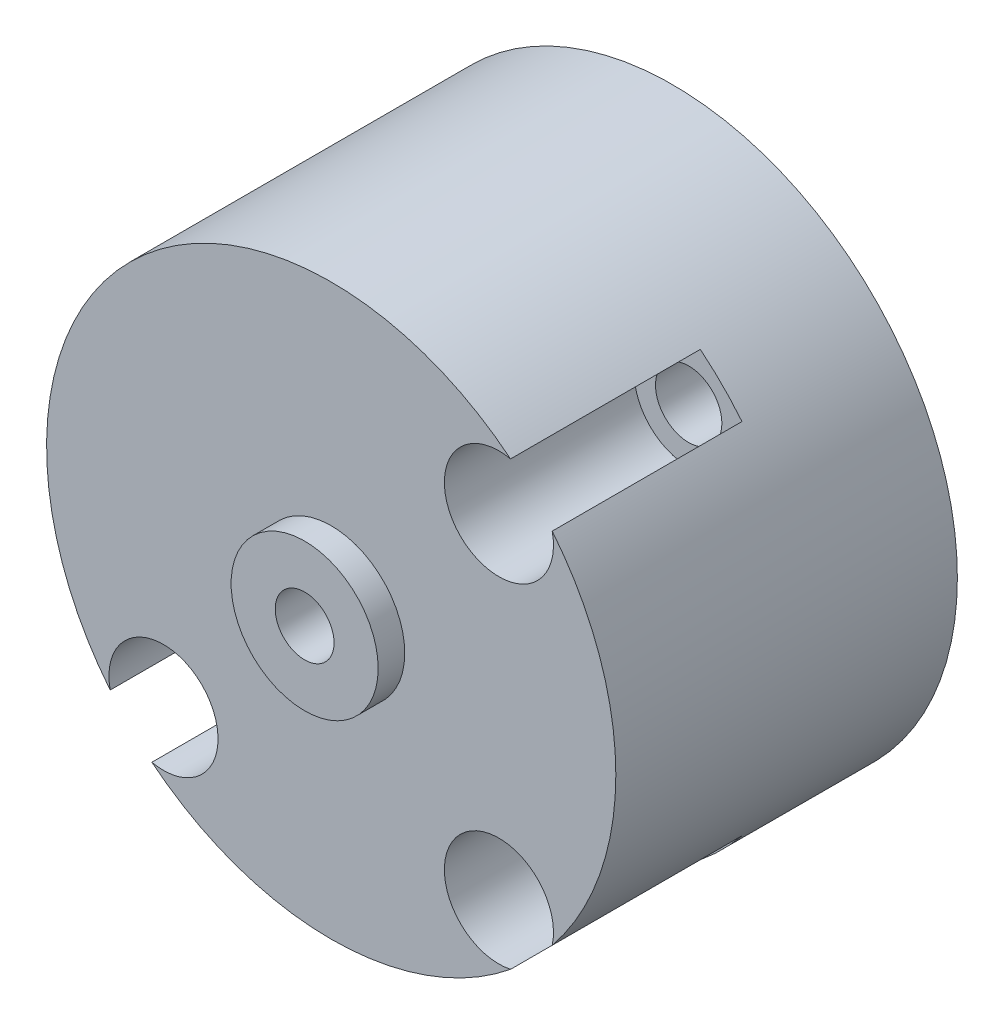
ISO-10303-21;
HEADER;
FILE_DESCRIPTION(('STEP AP214'),'2;1');
FILE_NAME('part.step','',(''),(''),'','','');
FILE_SCHEMA(('AUTOMOTIVE_DESIGN { 1 0 10303 214 1 1 1 1 }'));
ENDSEC;
DATA;
#1=APPLICATION_CONTEXT('core data for automotive mechanical design processes');
#2=APPLICATION_PROTOCOL_DEFINITION('international standard','automotive_design',2000,#1);
#3=PRODUCT_CONTEXT('',#1,'mechanical');
#4=PRODUCT('Part','Part','',(#3));
#5=PRODUCT_RELATED_PRODUCT_CATEGORY('part','',(#4));
#6=PRODUCT_DEFINITION_FORMATION('','',#4);
#7=PRODUCT_DEFINITION_CONTEXT('part definition',#1,'design');
#8=PRODUCT_DEFINITION('design','',#6,#7);
#9=PRODUCT_DEFINITION_SHAPE('','',#8);
#10=(LENGTH_UNIT() NAMED_UNIT(*) SI_UNIT(.MILLI.,.METRE.));
#11=(NAMED_UNIT(*) PLANE_ANGLE_UNIT() SI_UNIT($,.RADIAN.));
#12=(NAMED_UNIT(*) SI_UNIT($,.STERADIAN.) SOLID_ANGLE_UNIT());
#13=UNCERTAINTY_MEASURE_WITH_UNIT(LENGTH_MEASURE(1.E-05),#10,'distance_accuracy_value','');
#14=(GEOMETRIC_REPRESENTATION_CONTEXT(3) GLOBAL_UNCERTAINTY_ASSIGNED_CONTEXT((#13)) GLOBAL_UNIT_ASSIGNED_CONTEXT((#10,
#11,#12)) REPRESENTATION_CONTEXT('',''));
#15=CARTESIAN_POINT('',(0.,0.,0.));
#16=DIRECTION('',(0.,0.,1.));
#17=DIRECTION('',(1.,0.,0.));
#18=AXIS2_PLACEMENT_3D('',#15,#16,#17);
#19=CARTESIAN_POINT('',(1.56529891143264E-12,158.044580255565,2.));
#20=DIRECTION('',(0.,0.,1.));
#21=DIRECTION('',(1.,0.,0.));
#22=AXIS2_PLACEMENT_3D('',#19,#20,#21);
#23=CYLINDRICAL_SURFACE('',#22,1.55);
#24=CARTESIAN_POINT('',(4.41053443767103E-13,158.044580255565,19.4));
#25=DIRECTION('',(0.,0.,1.));
#26=DIRECTION('',(1.,0.,0.));
#27=AXIS2_PLACEMENT_3D('',#24,#25,#26);
#28=CIRCLE('',#27,1.55);
#29=CARTESIAN_POINT('',(1.55000000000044,158.044580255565,19.4));
#30=VERTEX_POINT('',#29);
#31=EDGE_CURVE('E207',#30,#30,#28,.T.);
#32=ORIENTED_EDGE('',*,*,#31,.T.);
#33=EDGE_LOOP('',(#32));
#34=FACE_BOUND('',#33,.T.);
#35=CARTESIAN_POINT('',(1.56529891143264E-12,158.044580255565,15.3));
#36=DIRECTION('',(0.,0.,-1.));
#37=DIRECTION('',(-1.,0.,0.));
#38=AXIS2_PLACEMENT_3D('',#35,#36,#37);
#39=CIRCLE('',#38,1.55);
#40=CARTESIAN_POINT('',(-1.54999999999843,158.044580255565,15.3));
#41=VERTEX_POINT('',#40);
#42=EDGE_CURVE('E176',#41,#41,#39,.F.);
#43=ORIENTED_EDGE('',*,*,#42,.F.);
#44=EDGE_LOOP('',(#43));
#45=FACE_BOUND('',#44,.T.);
#46=ADVANCED_FACE('F37',(#34,#45),#23,.F.);
#47=CARTESIAN_POINT('',(1.56529891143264E-12,158.044580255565,18.));
#48=DIRECTION('',(0.,0.,1.));
#49=DIRECTION('',(1.,0.,0.));
#50=AXIS2_PLACEMENT_3D('',#47,#48,#49);
#51=PLANE('',#50);
#52=CARTESIAN_POINT('',(8.8388347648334,166.883415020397,18.));
#53=DIRECTION('',(0.,0.,1.));
#54=DIRECTION('',(1.,0.,0.));
#55=AXIS2_PLACEMENT_3D('',#52,#53,#54);
#56=CIRCLE('',#55,2.875);
#57=CARTESIAN_POINT('',(9.45135409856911,169.692408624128,18.));
#58=VERTEX_POINT('',#57);
#59=CARTESIAN_POINT('',(11.6478283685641,167.495934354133,18.));
#60=VERTEX_POINT('',#59);
#61=EDGE_CURVE('E193',#58,#60,#56,.T.);
#62=ORIENTED_EDGE('',*,*,#61,.F.);
#63=CARTESIAN_POINT('',(1.56529891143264E-12,158.044580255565,18.));
#64=DIRECTION('',(0.,0.,1.));
#65=DIRECTION('',(1.,0.,0.));
#66=AXIS2_PLACEMENT_3D('',#63,#64,#65);
#67=CIRCLE('',#66,15.);
#68=CARTESIAN_POINT('',(-11.6478283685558,148.593226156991,18.));
#69=VERTEX_POINT('',#68);
#70=EDGE_CURVE('E220',#58,#69,#67,.T.);
#71=ORIENTED_EDGE('',*,*,#70,.T.);
#72=CARTESIAN_POINT('',(-8.83883476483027,149.205745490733,18.));
#73=DIRECTION('',(0.,0.,1.));
#74=DIRECTION('',(1.,0.,0.));
#75=AXIS2_PLACEMENT_3D('',#72,#73,#74);
#76=CIRCLE('',#75,2.87499999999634);
#77=CARTESIAN_POINT('',(-9.4513540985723,146.396751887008,18.));
#78=VERTEX_POINT('',#77);
#79=EDGE_CURVE('E199',#78,#69,#76,.T.);
#80=ORIENTED_EDGE('',*,*,#79,.F.);
#81=CARTESIAN_POINT('',(9.45135409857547,146.396751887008,18.));
#82=VERTEX_POINT('',#81);
#83=EDGE_CURVE('E219',#78,#82,#67,.T.);
#84=ORIENTED_EDGE('',*,*,#83,.T.);
#85=CARTESIAN_POINT('',(8.83883476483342,149.205745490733,18.));
#86=DIRECTION('',(0.,0.,1.));
#87=DIRECTION('',(1.,0.,0.));
#88=AXIS2_PLACEMENT_3D('',#85,#86,#87);
#89=CIRCLE('',#88,2.87499999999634);
#90=CARTESIAN_POINT('',(11.647828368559,148.593226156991,18.));
#91=VERTEX_POINT('',#90);
#92=EDGE_CURVE('E195',#91,#82,#89,.T.);
#93=ORIENTED_EDGE('',*,*,#92,.F.);
#94=EDGE_CURVE('E214',#91,#60,#67,.T.);
#95=ORIENTED_EDGE('',*,*,#94,.T.);
#96=EDGE_LOOP('',(#62,#71,#80,#84,#93,#95));
#97=FACE_BOUND('',#96,.T.);
#98=CARTESIAN_POINT('',(4.41053443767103E-13,158.044580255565,18.));
#99=DIRECTION('',(0.,0.,1.));
#100=DIRECTION('',(1.,0.,0.));
#101=AXIS2_PLACEMENT_3D('',#98,#99,#100);
#102=CIRCLE('',#101,3.875);
#103=CARTESIAN_POINT('',(3.87500000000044,158.044580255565,18.));
#104=VERTEX_POINT('',#103);
#105=EDGE_CURVE('E210',#104,#104,#102,.T.);
#106=ORIENTED_EDGE('',*,*,#105,.F.);
#107=EDGE_LOOP('',(#106));
#108=FACE_BOUND('',#107,.T.);
#109=ADVANCED_FACE('F282',(#97,#108),#51,.T.);
#110=CARTESIAN_POINT('',(8.83883476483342,149.205745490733,5.));
#111=DIRECTION('',(0.,0.,-1.));
#112=DIRECTION('',(-1.,0.,0.));
#113=AXIS2_PLACEMENT_3D('',#110,#111,#112);
#114=CYLINDRICAL_SURFACE('',#113,1.75);
#115=CARTESIAN_POINT('',(8.83883476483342,149.205745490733,0.));
#116=DIRECTION('',(0.,0.,1.));
#117=DIRECTION('',(1.,0.,0.));
#118=AXIS2_PLACEMENT_3D('',#115,#116,#117);
#119=CIRCLE('',#118,1.75);
#120=CARTESIAN_POINT('',(10.5888347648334,149.205745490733,0.));
#121=VERTEX_POINT('',#120);
#122=EDGE_CURVE('E227',#121,#121,#119,.T.);
#123=ORIENTED_EDGE('',*,*,#122,.F.);
#124=EDGE_LOOP('',(#123));
#125=FACE_BOUND('',#124,.T.);
#126=CARTESIAN_POINT('',(8.83883476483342,149.205745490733,8.));
#127=DIRECTION('',(0.,0.,1.));
#128=DIRECTION('',(1.,0.,0.));
#129=AXIS2_PLACEMENT_3D('',#126,#127,#128);
#130=CIRCLE('',#129,1.75);
#131=CARTESIAN_POINT('',(10.5888347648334,149.205745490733,8.));
#132=VERTEX_POINT('',#131);
#133=EDGE_CURVE('E251',#132,#132,#130,.T.);
#134=ORIENTED_EDGE('',*,*,#133,.T.);
#135=EDGE_LOOP('',(#134));
#136=FACE_BOUND('',#135,.T.);
#137=ADVANCED_FACE('F308',(#125,#136),#114,.F.);
#138=CARTESIAN_POINT('',(8.8388347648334,166.883415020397,5.));
#139=DIRECTION('',(0.,0.,-1.));
#140=DIRECTION('',(-1.,0.,0.));
#141=AXIS2_PLACEMENT_3D('',#138,#139,#140);
#142=CYLINDRICAL_SURFACE('',#141,1.75);
#143=CARTESIAN_POINT('',(8.8388347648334,166.883415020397,0.));
#144=DIRECTION('',(0.,0.,1.));
#145=DIRECTION('',(1.,0.,0.));
#146=AXIS2_PLACEMENT_3D('',#143,#144,#145);
#147=CIRCLE('',#146,1.75);
#148=CARTESIAN_POINT('',(10.5888347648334,166.883415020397,0.));
#149=VERTEX_POINT('',#148);
#150=EDGE_CURVE('E224',#149,#149,#147,.T.);
#151=ORIENTED_EDGE('',*,*,#150,.F.);
#152=EDGE_LOOP('',(#151));
#153=FACE_BOUND('',#152,.T.);
#154=CARTESIAN_POINT('',(8.8388347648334,166.883415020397,8.));
#155=DIRECTION('',(0.,0.,1.));
#156=DIRECTION('',(1.,0.,0.));
#157=AXIS2_PLACEMENT_3D('',#154,#155,#156);
#158=CIRCLE('',#157,1.75);
#159=CARTESIAN_POINT('',(10.5888347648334,166.883415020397,8.));
#160=VERTEX_POINT('',#159);
#161=EDGE_CURVE('E249',#160,#160,#158,.T.);
#162=ORIENTED_EDGE('',*,*,#161,.T.);
#163=EDGE_LOOP('',(#162));
#164=FACE_BOUND('',#163,.T.);
#165=ADVANCED_FACE('F316',(#153,#164),#142,.F.);
#166=CARTESIAN_POINT('',(-8.83883476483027,149.205745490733,5.));
#167=DIRECTION('',(0.,0.,-1.));
#168=DIRECTION('',(-1.,0.,0.));
#169=AXIS2_PLACEMENT_3D('',#166,#167,#168);
#170=CYLINDRICAL_SURFACE('',#169,1.75);
#171=CARTESIAN_POINT('',(-8.83883476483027,149.205745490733,0.));
#172=DIRECTION('',(0.,0.,1.));
#173=DIRECTION('',(1.,0.,0.));
#174=AXIS2_PLACEMENT_3D('',#171,#172,#173);
#175=CIRCLE('',#174,1.75);
#176=CARTESIAN_POINT('',(-7.08883476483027,149.205745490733,0.));
#177=VERTEX_POINT('',#176);
#178=EDGE_CURVE('E221',#177,#177,#175,.T.);
#179=ORIENTED_EDGE('',*,*,#178,.F.);
#180=EDGE_LOOP('',(#179));
#181=FACE_BOUND('',#180,.T.);
#182=CARTESIAN_POINT('',(-8.83883476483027,149.205745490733,8.));
#183=DIRECTION('',(0.,0.,1.));
#184=DIRECTION('',(1.,0.,0.));
#185=AXIS2_PLACEMENT_3D('',#182,#183,#184);
#186=CIRCLE('',#185,1.75);
#187=CARTESIAN_POINT('',(-7.08883476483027,149.205745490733,8.));
#188=VERTEX_POINT('',#187);
#189=EDGE_CURVE('E41',#188,#188,#186,.T.);
#190=ORIENTED_EDGE('',*,*,#189,.T.);
#191=EDGE_LOOP('',(#190));
#192=FACE_BOUND('',#191,.T.);
#193=ADVANCED_FACE('F258',(#181,#192),#170,.F.);
#194=CARTESIAN_POINT('',(1.56529891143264E-12,158.044580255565,0.));
#195=DIRECTION('',(0.,0.,1.));
#196=DIRECTION('',(1.,0.,0.));
#197=AXIS2_PLACEMENT_3D('',#194,#195,#196);
#198=PLANE('',#197);
#199=CARTESIAN_POINT('',(-4.53416912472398E-11,158.044580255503,0.));
#200=DIRECTION('',(0.,0.,-1.));
#201=DIRECTION('',(-1.,0.,0.));
#202=AXIS2_PLACEMENT_3D('',#199,#200,#201);
#203=CIRCLE('',#202,3.99999999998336);
#204=CARTESIAN_POINT('',(-4.00000000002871,158.044580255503,0.));
#205=VERTEX_POINT('',#204);
#206=EDGE_CURVE('E188',#205,#205,#203,.T.);
#207=ORIENTED_EDGE('',*,*,#206,.F.);
#208=EDGE_LOOP('',(#207));
#209=FACE_BOUND('',#208,.T.);
#210=CARTESIAN_POINT('',(1.56529891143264E-12,158.044580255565,0.));
#211=DIRECTION('',(0.,0.,1.));
#212=DIRECTION('',(1.,0.,0.));
#213=AXIS2_PLACEMENT_3D('',#210,#211,#212);
#214=CIRCLE('',#213,15.);
#215=CARTESIAN_POINT('',(15.0000000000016,158.044580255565,0.));
#216=VERTEX_POINT('',#215);
#217=EDGE_CURVE('E230',#216,#216,#214,.T.);
#218=ORIENTED_EDGE('',*,*,#217,.F.);
#219=EDGE_LOOP('',(#218));
#220=FACE_BOUND('',#219,.T.);
#221=ORIENTED_EDGE('',*,*,#122,.T.);
#222=EDGE_LOOP('',(#221));
#223=FACE_BOUND('',#222,.T.);
#224=ORIENTED_EDGE('',*,*,#150,.T.);
#225=EDGE_LOOP('',(#224));
#226=FACE_BOUND('',#225,.T.);
#227=ORIENTED_EDGE('',*,*,#178,.T.);
#228=EDGE_LOOP('',(#227));
#229=FACE_BOUND('',#228,.T.);
#230=ADVANCED_FACE('F315',(#209,#220,#223,#226,#229),#198,.F.);
#231=CARTESIAN_POINT('',(1.56529891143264E-12,158.044580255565,5.));
#232=DIRECTION('',(0.,0.,-1.));
#233=DIRECTION('',(-1.,0.,0.));
#234=AXIS2_PLACEMENT_3D('',#231,#232,#233);
#235=CYLINDRICAL_SURFACE('',#234,15.);
#236=ORIENTED_EDGE('',*,*,#217,.T.);
#237=EDGE_LOOP('',(#236));
#238=FACE_BOUND('',#237,.T.);
#239=CARTESIAN_POINT('',(1.56529891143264E-12,158.044580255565,8.));
#240=DIRECTION('',(0.,0.,1.));
#241=DIRECTION('',(1.,0.,0.));
#242=AXIS2_PLACEMENT_3D('',#239,#240,#241);
#243=CIRCLE('',#242,15.);
#244=CARTESIAN_POINT('',(11.6478283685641,167.495934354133,8.));
#245=VERTEX_POINT('',#244);
#246=CARTESIAN_POINT('',(9.45135409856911,169.692408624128,8.));
#247=VERTEX_POINT('',#246);
#248=EDGE_CURVE('E205',#245,#247,#243,.T.);
#249=ORIENTED_EDGE('',*,*,#248,.F.);
#250=DIRECTION('',(0.,0.,1.));
#251=VECTOR('',#250,1.);
#252=CARTESIAN_POINT('',(11.6478283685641,167.495934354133,13.));
#253=LINE('',#252,#251);
#254=EDGE_CURVE('E11',#245,#60,#253,.T.);
#255=ORIENTED_EDGE('',*,*,#254,.T.);
#256=ORIENTED_EDGE('',*,*,#94,.F.);
#257=DIRECTION('',(0.,0.,1.));
#258=VECTOR('',#257,1.);
#259=CARTESIAN_POINT('',(11.647828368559,148.593226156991,13.));
#260=LINE('',#259,#258);
#261=CARTESIAN_POINT('',(11.647828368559,148.593226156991,8.));
#262=VERTEX_POINT('',#261);
#263=EDGE_CURVE('E239',#91,#262,#260,.F.);
#264=ORIENTED_EDGE('',*,*,#263,.T.);
#265=CARTESIAN_POINT('',(1.56529891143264E-12,158.044580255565,8.));
#266=DIRECTION('',(0.,0.,1.));
#267=DIRECTION('',(1.,0.,0.));
#268=AXIS2_PLACEMENT_3D('',#265,#266,#267);
#269=CIRCLE('',#268,15.);
#270=CARTESIAN_POINT('',(9.45135409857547,146.396751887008,8.));
#271=VERTEX_POINT('',#270);
#272=EDGE_CURVE('E203',#271,#262,#269,.T.);
#273=ORIENTED_EDGE('',*,*,#272,.F.);
#274=DIRECTION('',(0.,0.,1.));
#275=VECTOR('',#274,1.);
#276=CARTESIAN_POINT('',(9.45135409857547,146.396751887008,13.));
#277=LINE('',#276,#275);
#278=EDGE_CURVE('E242',#271,#82,#277,.T.);
#279=ORIENTED_EDGE('',*,*,#278,.T.);
#280=ORIENTED_EDGE('',*,*,#83,.F.);
#281=DIRECTION('',(0.,0.,1.));
#282=VECTOR('',#281,1.);
#283=CARTESIAN_POINT('',(-9.45135409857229,146.396751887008,13.));
#284=LINE('',#283,#282);
#285=CARTESIAN_POINT('',(-9.4513540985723,146.396751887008,8.));
#286=VERTEX_POINT('',#285);
#287=EDGE_CURVE('E233',#78,#286,#284,.F.);
#288=ORIENTED_EDGE('',*,*,#287,.T.);
#289=CARTESIAN_POINT('',(1.56529891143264E-12,158.044580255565,8.));
#290=DIRECTION('',(0.,0.,1.));
#291=DIRECTION('',(1.,0.,0.));
#292=AXIS2_PLACEMENT_3D('',#289,#290,#291);
#293=CIRCLE('',#292,15.);
#294=CARTESIAN_POINT('',(-11.6478283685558,148.593226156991,8.));
#295=VERTEX_POINT('',#294);
#296=EDGE_CURVE('E192',#295,#286,#293,.T.);
#297=ORIENTED_EDGE('',*,*,#296,.F.);
#298=DIRECTION('',(0.,0.,1.));
#299=VECTOR('',#298,1.);
#300=CARTESIAN_POINT('',(-11.6478283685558,148.593226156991,13.));
#301=LINE('',#300,#299);
#302=EDGE_CURVE('E236',#295,#69,#301,.T.);
#303=ORIENTED_EDGE('',*,*,#302,.T.);
#304=ORIENTED_EDGE('',*,*,#70,.F.);
#305=DIRECTION('',(0.,0.,1.));
#306=VECTOR('',#305,1.);
#307=CARTESIAN_POINT('',(9.45135409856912,169.692408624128,13.));
#308=LINE('',#307,#306);
#309=EDGE_CURVE('E46',#58,#247,#308,.F.);
#310=ORIENTED_EDGE('',*,*,#309,.T.);
#311=EDGE_LOOP('',(#249,#255,#256,#264,#273,#279,#280,#288,#297,#303,#304,#310));
#312=FACE_BOUND('',#311,.T.);
#313=ADVANCED_FACE('F39',(#238,#312),#235,.T.);
#314=CARTESIAN_POINT('',(4.41053443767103E-13,158.044580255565,19.4));
#315=DIRECTION('',(0.,0.,1.));
#316=DIRECTION('',(1.,0.,0.));
#317=AXIS2_PLACEMENT_3D('',#314,#315,#316);
#318=PLANE('',#317);
#319=CARTESIAN_POINT('',(4.41053443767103E-13,158.044580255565,19.4));
#320=DIRECTION('',(0.,0.,1.));
#321=DIRECTION('',(1.,0.,0.));
#322=AXIS2_PLACEMENT_3D('',#319,#320,#321);
#323=CIRCLE('',#322,3.875);
#324=CARTESIAN_POINT('',(3.87500000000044,158.044580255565,19.4));
#325=VERTEX_POINT('',#324);
#326=EDGE_CURVE('E211',#325,#325,#323,.T.);
#327=ORIENTED_EDGE('',*,*,#326,.T.);
#328=EDGE_LOOP('',(#327));
#329=FACE_BOUND('',#328,.T.);
#330=ORIENTED_EDGE('',*,*,#31,.F.);
#331=EDGE_LOOP('',(#330));
#332=FACE_BOUND('',#331,.T.);
#333=ADVANCED_FACE('F328',(#329,#332),#318,.T.);
#334=CARTESIAN_POINT('',(4.41053443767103E-13,158.044580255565,19.4));
#335=DIRECTION('',(0.,0.,-1.));
#336=DIRECTION('',(-1.,0.,0.));
#337=AXIS2_PLACEMENT_3D('',#334,#335,#336);
#338=CYLINDRICAL_SURFACE('',#337,3.875);
#339=ORIENTED_EDGE('',*,*,#326,.F.);
#340=EDGE_LOOP('',(#339));
#341=FACE_BOUND('',#340,.T.);
#342=ORIENTED_EDGE('',*,*,#105,.T.);
#343=EDGE_LOOP('',(#342));
#344=FACE_BOUND('',#343,.T.);
#345=ADVANCED_FACE('F520',(#341,#344),#338,.T.);
#346=CARTESIAN_POINT('',(-8.83883476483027,149.205745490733,8.));
#347=DIRECTION('',(0.,0.,1.));
#348=DIRECTION('',(1.,0.,0.));
#349=AXIS2_PLACEMENT_3D('',#346,#347,#348);
#350=CYLINDRICAL_SURFACE('',#349,2.87499999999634);
#351=CARTESIAN_POINT('',(-8.83883476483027,149.205745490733,8.));
#352=DIRECTION('',(0.,0.,1.));
#353=DIRECTION('',(1.,0.,0.));
#354=AXIS2_PLACEMENT_3D('',#351,#352,#353);
#355=CIRCLE('',#354,2.87499999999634);
#356=EDGE_CURVE('E187',#286,#295,#355,.T.);
#357=ORIENTED_EDGE('',*,*,#356,.F.);
#358=ORIENTED_EDGE('',*,*,#287,.F.);
#359=ORIENTED_EDGE('',*,*,#79,.T.);
#360=ORIENTED_EDGE('',*,*,#302,.F.);
#361=EDGE_LOOP('',(#357,#358,#359,#360));
#362=FACE_BOUND('',#361,.T.);
#363=ADVANCED_FACE('F264',(#362),#350,.F.);
#364=CARTESIAN_POINT('',(-8.83883476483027,149.205745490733,8.));
#365=DIRECTION('',(0.,0.,1.));
#366=DIRECTION('',(1.,0.,0.));
#367=AXIS2_PLACEMENT_3D('',#364,#365,#366);
#368=PLANE('',#367);
#369=ORIENTED_EDGE('',*,*,#189,.F.);
#370=EDGE_LOOP('',(#369));
#371=FACE_BOUND('',#370,.T.);
#372=ORIENTED_EDGE('',*,*,#296,.T.);
#373=ORIENTED_EDGE('',*,*,#356,.T.);
#374=EDGE_LOOP('',(#372,#373));
#375=FACE_BOUND('',#374,.T.);
#376=ADVANCED_FACE('F260',(#371,#375),#368,.T.);
#377=CARTESIAN_POINT('',(8.83883476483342,149.205745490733,8.));
#378=DIRECTION('',(0.,0.,1.));
#379=DIRECTION('',(1.,0.,0.));
#380=AXIS2_PLACEMENT_3D('',#377,#378,#379);
#381=CYLINDRICAL_SURFACE('',#380,2.87499999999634);
#382=CARTESIAN_POINT('',(8.83883476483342,149.205745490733,8.));
#383=DIRECTION('',(0.,0.,1.));
#384=DIRECTION('',(1.,0.,0.));
#385=AXIS2_PLACEMENT_3D('',#382,#383,#384);
#386=CIRCLE('',#385,2.87499999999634);
#387=EDGE_CURVE('E197',#262,#271,#386,.T.);
#388=ORIENTED_EDGE('',*,*,#387,.F.);
#389=ORIENTED_EDGE('',*,*,#263,.F.);
#390=ORIENTED_EDGE('',*,*,#92,.T.);
#391=ORIENTED_EDGE('',*,*,#278,.F.);
#392=EDGE_LOOP('',(#388,#389,#390,#391));
#393=FACE_BOUND('',#392,.T.);
#394=ADVANCED_FACE('F263',(#393),#381,.F.);
#395=CARTESIAN_POINT('',(8.83883476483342,149.205745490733,8.));
#396=DIRECTION('',(0.,0.,1.));
#397=DIRECTION('',(1.,0.,0.));
#398=AXIS2_PLACEMENT_3D('',#395,#396,#397);
#399=PLANE('',#398);
#400=ORIENTED_EDGE('',*,*,#133,.F.);
#401=EDGE_LOOP('',(#400));
#402=FACE_BOUND('',#401,.T.);
#403=ORIENTED_EDGE('',*,*,#272,.T.);
#404=ORIENTED_EDGE('',*,*,#387,.T.);
#405=EDGE_LOOP('',(#403,#404));
#406=FACE_BOUND('',#405,.T.);
#407=ADVANCED_FACE('F290',(#402,#406),#399,.T.);
#408=CARTESIAN_POINT('',(8.8388347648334,166.883415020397,8.));
#409=DIRECTION('',(0.,0.,1.));
#410=DIRECTION('',(1.,0.,0.));
#411=AXIS2_PLACEMENT_3D('',#408,#409,#410);
#412=CYLINDRICAL_SURFACE('',#411,2.875);
#413=CARTESIAN_POINT('',(8.8388347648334,166.883415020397,8.));
#414=DIRECTION('',(0.,0.,1.));
#415=DIRECTION('',(1.,0.,0.));
#416=AXIS2_PLACEMENT_3D('',#413,#414,#415);
#417=CIRCLE('',#416,2.875);
#418=EDGE_CURVE('E61',#247,#245,#417,.T.);
#419=ORIENTED_EDGE('',*,*,#418,.F.);
#420=ORIENTED_EDGE('',*,*,#309,.F.);
#421=ORIENTED_EDGE('',*,*,#61,.T.);
#422=ORIENTED_EDGE('',*,*,#254,.F.);
#423=EDGE_LOOP('',(#419,#420,#421,#422));
#424=FACE_BOUND('',#423,.T.);
#425=ADVANCED_FACE('F285',(#424),#412,.F.);
#426=CARTESIAN_POINT('',(8.8388347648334,166.883415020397,8.));
#427=DIRECTION('',(0.,0.,1.));
#428=DIRECTION('',(1.,0.,0.));
#429=AXIS2_PLACEMENT_3D('',#426,#427,#428);
#430=PLANE('',#429);
#431=ORIENTED_EDGE('',*,*,#161,.F.);
#432=EDGE_LOOP('',(#431));
#433=FACE_BOUND('',#432,.T.);
#434=ORIENTED_EDGE('',*,*,#248,.T.);
#435=ORIENTED_EDGE('',*,*,#418,.T.);
#436=EDGE_LOOP('',(#434,#435));
#437=FACE_BOUND('',#436,.T.);
#438=ADVANCED_FACE('F298',(#433,#437),#430,.T.);
#439=CARTESIAN_POINT('',(-4.53416912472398E-11,158.044580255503,12.));
#440=DIRECTION('',(0.,0.,-1.));
#441=DIRECTION('',(-1.,0.,0.));
#442=AXIS2_PLACEMENT_3D('',#439,#440,#441);
#443=PLANE('',#442);
#444=DIRECTION('',(0.260031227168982,0.965600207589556,0.));
#445=VECTOR('',#444,1.);
#446=CARTESIAN_POINT('',(-3.62612024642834,157.077840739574,12.));
#447=LINE('',#446,#445);
#448=CARTESIAN_POINT('',(-3.62612024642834,157.077840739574,12.));
#449=VERTEX_POINT('',#448);
#450=CARTESIAN_POINT('',(-2.65028110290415,160.701522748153,12.));
#451=VERTEX_POINT('',#450);
#452=EDGE_CURVE('E54',#449,#451,#447,.T.);
#453=ORIENTED_EDGE('',*,*,#452,.F.);
#454=DIRECTION('',(-0.706218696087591,0.70799375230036,0.));
#455=VECTOR('',#454,1.);
#456=CARTESIAN_POINT('',(-0.975839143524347,154.420898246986,12.));
#457=LINE('',#456,#455);
#458=CARTESIAN_POINT('',(-0.975839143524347,154.420898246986,12.));
#459=VERTEX_POINT('',#458);
#460=EDGE_CURVE('E150',#459,#449,#457,.T.);
#461=ORIENTED_EDGE('',*,*,#460,.F.);
#462=DIRECTION('',(-0.966249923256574,-0.257606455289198,0.));
#463=VECTOR('',#462,1.);
#464=CARTESIAN_POINT('',(2.65028110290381,155.387637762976,12.));
#465=LINE('',#464,#463);
#466=CARTESIAN_POINT('',(2.65028110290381,155.387637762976,12.));
#467=VERTEX_POINT('',#466);
#468=EDGE_CURVE('E153',#467,#459,#465,.T.);
#469=ORIENTED_EDGE('',*,*,#468,.F.);
#470=DIRECTION('',(-0.260031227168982,-0.965600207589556,0.));
#471=VECTOR('',#470,1.);
#472=CARTESIAN_POINT('',(3.626120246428,159.011319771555,12.));
#473=LINE('',#472,#471);
#474=CARTESIAN_POINT('',(3.626120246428,159.011319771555,12.));
#475=VERTEX_POINT('',#474);
#476=EDGE_CURVE('E169',#475,#467,#473,.T.);
#477=ORIENTED_EDGE('',*,*,#476,.F.);
#478=DIRECTION('',(0.706218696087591,-0.707993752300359,0.));
#479=VECTOR('',#478,1.);
#480=CARTESIAN_POINT('',(0.975839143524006,161.668262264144,12.));
#481=LINE('',#480,#479);
#482=CARTESIAN_POINT('',(0.975839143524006,161.668262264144,12.));
#483=VERTEX_POINT('',#482);
#484=EDGE_CURVE('E166',#483,#475,#481,.T.);
#485=ORIENTED_EDGE('',*,*,#484,.F.);
#486=DIRECTION('',(0.966249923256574,0.257606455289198,0.));
#487=VECTOR('',#486,1.);
#488=CARTESIAN_POINT('',(-2.65028110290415,160.701522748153,12.));
#489=LINE('',#488,#487);
#490=EDGE_CURVE('E164',#451,#483,#489,.T.);
#491=ORIENTED_EDGE('',*,*,#490,.F.);
#492=EDGE_LOOP('',(#453,#461,#469,#477,#485,#491));
#493=FACE_BOUND('',#492,.T.);
#494=CARTESIAN_POINT('',(-4.53416912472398E-11,158.044580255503,12.));
#495=DIRECTION('',(0.,0.,-1.));
#496=DIRECTION('',(-1.,0.,0.));
#497=AXIS2_PLACEMENT_3D('',#494,#495,#496);
#498=CIRCLE('',#497,3.99999999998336);
#499=CARTESIAN_POINT('',(-4.00000000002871,158.044580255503,12.));
#500=VERTEX_POINT('',#499);
#501=EDGE_CURVE('E184',#500,#500,#498,.T.);
#502=ORIENTED_EDGE('',*,*,#501,.T.);
#503=EDGE_LOOP('',(#502));
#504=FACE_BOUND('',#503,.T.);
#505=ADVANCED_FACE('F343',(#493,#504),#443,.T.);
#506=CARTESIAN_POINT('',(-4.53416912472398E-11,158.044580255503,12.));
#507=DIRECTION('',(0.,0.,-1.));
#508=DIRECTION('',(-1.,0.,0.));
#509=AXIS2_PLACEMENT_3D('',#506,#507,#508);
#510=CYLINDRICAL_SURFACE('',#509,3.99999999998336);
#511=ORIENTED_EDGE('',*,*,#501,.F.);
#512=EDGE_LOOP('',(#511));
#513=FACE_BOUND('',#512,.T.);
#514=ORIENTED_EDGE('',*,*,#206,.T.);
#515=EDGE_LOOP('',(#514));
#516=FACE_BOUND('',#515,.T.);
#517=ADVANCED_FACE('F348',(#513,#516),#510,.F.);
#518=CARTESIAN_POINT('',(0.,0.,15.3));
#519=DIRECTION('',(0.,0.,-1.));
#520=DIRECTION('',(-1.,0.,0.));
#521=AXIS2_PLACEMENT_3D('',#518,#519,#520);
#522=PLANE('',#521);
#523=DIRECTION('',(0.260031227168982,0.965600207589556,0.));
#524=VECTOR('',#523,1.);
#525=CARTESIAN_POINT('',(-3.62612024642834,157.077840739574,15.3));
#526=LINE('',#525,#524);
#527=CARTESIAN_POINT('',(-3.62612024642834,157.077840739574,15.3));
#528=VERTEX_POINT('',#527);
#529=CARTESIAN_POINT('',(-2.65028110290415,160.701522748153,15.3));
#530=VERTEX_POINT('',#529);
#531=EDGE_CURVE('E130',#528,#530,#526,.T.);
#532=ORIENTED_EDGE('',*,*,#531,.T.);
#533=DIRECTION('',(0.966249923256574,0.257606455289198,0.));
#534=VECTOR('',#533,1.);
#535=CARTESIAN_POINT('',(-2.65028110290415,160.701522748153,15.3));
#536=LINE('',#535,#534);
#537=CARTESIAN_POINT('',(0.975839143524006,161.668262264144,15.3));
#538=VERTEX_POINT('',#537);
#539=EDGE_CURVE('E139',#530,#538,#536,.T.);
#540=ORIENTED_EDGE('',*,*,#539,.T.);
#541=DIRECTION('',(0.706218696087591,-0.707993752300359,0.));
#542=VECTOR('',#541,1.);
#543=CARTESIAN_POINT('',(0.975839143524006,161.668262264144,15.3));
#544=LINE('',#543,#542);
#545=CARTESIAN_POINT('',(3.626120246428,159.011319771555,15.3));
#546=VERTEX_POINT('',#545);
#547=EDGE_CURVE('E144',#538,#546,#544,.T.);
#548=ORIENTED_EDGE('',*,*,#547,.T.);
#549=DIRECTION('',(-0.260031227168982,-0.965600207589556,0.));
#550=VECTOR('',#549,1.);
#551=CARTESIAN_POINT('',(3.626120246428,159.011319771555,15.3));
#552=LINE('',#551,#550);
#553=CARTESIAN_POINT('',(2.65028110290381,155.387637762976,15.3));
#554=VERTEX_POINT('',#553);
#555=EDGE_CURVE('E157',#546,#554,#552,.T.);
#556=ORIENTED_EDGE('',*,*,#555,.T.);
#557=DIRECTION('',(-0.966249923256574,-0.257606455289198,0.));
#558=VECTOR('',#557,1.);
#559=CARTESIAN_POINT('',(2.65028110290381,155.387637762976,15.3));
#560=LINE('',#559,#558);
#561=CARTESIAN_POINT('',(-0.975839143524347,154.420898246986,15.3));
#562=VERTEX_POINT('',#561);
#563=EDGE_CURVE('E160',#554,#562,#560,.T.);
#564=ORIENTED_EDGE('',*,*,#563,.T.);
#565=DIRECTION('',(-0.706218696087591,0.70799375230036,0.));
#566=VECTOR('',#565,1.);
#567=CARTESIAN_POINT('',(-0.975839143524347,154.420898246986,15.3));
#568=LINE('',#567,#566);
#569=EDGE_CURVE('E136',#562,#528,#568,.T.);
#570=ORIENTED_EDGE('',*,*,#569,.T.);
#571=EDGE_LOOP('',(#532,#540,#548,#556,#564,#570));
#572=FACE_BOUND('',#571,.T.);
#573=ORIENTED_EDGE('',*,*,#42,.T.);
#574=EDGE_LOOP('',(#573));
#575=FACE_BOUND('',#574,.T.);
#576=ADVANCED_FACE('F146',(#572,#575),#522,.T.);
#577=CARTESIAN_POINT('',(-3.62612024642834,157.077840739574,15.3));
#578=DIRECTION('',(-0.965600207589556,0.260031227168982,0.));
#579=DIRECTION('',(-0.260031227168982,-0.965600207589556,0.));
#580=AXIS2_PLACEMENT_3D('',#577,#578,#579);
#581=PLANE('',#580);
#582=ORIENTED_EDGE('',*,*,#452,.T.);
#583=DIRECTION('',(0.,0.,-1.));
#584=VECTOR('',#583,1.);
#585=CARTESIAN_POINT('',(-2.65028110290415,160.701522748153,15.3));
#586=LINE('',#585,#584);
#587=EDGE_CURVE('E126',#530,#451,#586,.T.);
#588=ORIENTED_EDGE('',*,*,#587,.F.);
#589=ORIENTED_EDGE('',*,*,#531,.F.);
#590=DIRECTION('',(0.,0.,-1.));
#591=VECTOR('',#590,1.);
#592=CARTESIAN_POINT('',(-3.62612024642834,157.077840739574,15.3));
#593=LINE('',#592,#591);
#594=EDGE_CURVE('E174',#528,#449,#593,.T.);
#595=ORIENTED_EDGE('',*,*,#594,.T.);
#596=EDGE_LOOP('',(#582,#588,#589,#595));
#597=FACE_BOUND('',#596,.T.);
#598=ADVANCED_FACE('F128',(#597),#581,.F.);
#599=CARTESIAN_POINT('',(-0.975839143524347,154.420898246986,15.3));
#600=DIRECTION('',(-0.70799375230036,-0.706218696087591,0.));
#601=DIRECTION('',(0.706218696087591,-0.70799375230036,0.));
#602=AXIS2_PLACEMENT_3D('',#599,#600,#601);
#603=PLANE('',#602);
#604=ORIENTED_EDGE('',*,*,#460,.T.);
#605=ORIENTED_EDGE('',*,*,#594,.F.);
#606=ORIENTED_EDGE('',*,*,#569,.F.);
#607=DIRECTION('',(0.,0.,-1.));
#608=VECTOR('',#607,1.);
#609=CARTESIAN_POINT('',(-0.975839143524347,154.420898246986,15.3));
#610=LINE('',#609,#608);
#611=EDGE_CURVE('E177',#562,#459,#610,.T.);
#612=ORIENTED_EDGE('',*,*,#611,.T.);
#613=EDGE_LOOP('',(#604,#605,#606,#612));
#614=FACE_BOUND('',#613,.T.);
#615=ADVANCED_FACE('F357',(#614),#603,.F.);
#616=CARTESIAN_POINT('',(2.65028110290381,155.387637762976,15.3));
#617=DIRECTION('',(0.257606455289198,-0.966249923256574,0.));
#618=DIRECTION('',(0.966249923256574,0.257606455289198,0.));
#619=AXIS2_PLACEMENT_3D('',#616,#617,#618);
#620=PLANE('',#619);
#621=ORIENTED_EDGE('',*,*,#468,.T.);
#622=ORIENTED_EDGE('',*,*,#611,.F.);
#623=ORIENTED_EDGE('',*,*,#563,.F.);
#624=DIRECTION('',(0.,0.,-1.));
#625=VECTOR('',#624,1.);
#626=CARTESIAN_POINT('',(2.65028110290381,155.387637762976,15.3));
#627=LINE('',#626,#625);
#628=EDGE_CURVE('E179',#554,#467,#627,.T.);
#629=ORIENTED_EDGE('',*,*,#628,.T.);
#630=EDGE_LOOP('',(#621,#622,#623,#629));
#631=FACE_BOUND('',#630,.T.);
#632=ADVANCED_FACE('F367',(#631),#620,.F.);
#633=CARTESIAN_POINT('',(3.626120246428,159.011319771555,15.3));
#634=DIRECTION('',(0.965600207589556,-0.260031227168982,0.));
#635=DIRECTION('',(0.260031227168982,0.965600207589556,0.));
#636=AXIS2_PLACEMENT_3D('',#633,#634,#635);
#637=PLANE('',#636);
#638=ORIENTED_EDGE('',*,*,#476,.T.);
#639=ORIENTED_EDGE('',*,*,#628,.F.);
#640=ORIENTED_EDGE('',*,*,#555,.F.);
#641=DIRECTION('',(0.,0.,-1.));
#642=VECTOR('',#641,1.);
#643=CARTESIAN_POINT('',(3.626120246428,159.011319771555,15.3));
#644=LINE('',#643,#642);
#645=EDGE_CURVE('E181',#546,#475,#644,.T.);
#646=ORIENTED_EDGE('',*,*,#645,.T.);
#647=EDGE_LOOP('',(#638,#639,#640,#646));
#648=FACE_BOUND('',#647,.T.);
#649=ADVANCED_FACE('F363',(#648),#637,.F.);
#650=CARTESIAN_POINT('',(0.975839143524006,161.668262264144,15.3));
#651=DIRECTION('',(0.707993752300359,0.706218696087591,0.));
#652=DIRECTION('',(-0.706218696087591,0.707993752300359,0.));
#653=AXIS2_PLACEMENT_3D('',#650,#651,#652);
#654=PLANE('',#653);
#655=ORIENTED_EDGE('',*,*,#484,.T.);
#656=ORIENTED_EDGE('',*,*,#645,.F.);
#657=ORIENTED_EDGE('',*,*,#547,.F.);
#658=DIRECTION('',(0.,0.,-1.));
#659=VECTOR('',#658,1.);
#660=CARTESIAN_POINT('',(0.975839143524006,161.668262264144,15.3));
#661=LINE('',#660,#659);
#662=EDGE_CURVE('E135',#538,#483,#661,.T.);
#663=ORIENTED_EDGE('',*,*,#662,.T.);
#664=EDGE_LOOP('',(#655,#656,#657,#663));
#665=FACE_BOUND('',#664,.T.);
#666=ADVANCED_FACE('F360',(#665),#654,.F.);
#667=CARTESIAN_POINT('',(-2.65028110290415,160.701522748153,15.3));
#668=DIRECTION('',(-0.257606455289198,0.966249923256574,0.));
#669=DIRECTION('',(-0.966249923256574,-0.257606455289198,0.));
#670=AXIS2_PLACEMENT_3D('',#667,#668,#669);
#671=PLANE('',#670);
#672=ORIENTED_EDGE('',*,*,#490,.T.);
#673=ORIENTED_EDGE('',*,*,#662,.F.);
#674=ORIENTED_EDGE('',*,*,#539,.F.);
#675=ORIENTED_EDGE('',*,*,#587,.T.);
#676=EDGE_LOOP('',(#672,#673,#674,#675));
#677=FACE_BOUND('',#676,.T.);
#678=ADVANCED_FACE('F140',(#677),#671,.F.);
#679=CLOSED_SHELL('',(#46,#109,#137,#165,#193,#230,#313,#333,#345,#363,#376,#394,#407,#425,#438,
#505,#517,#576,#598,#615,#632,#649,#666,#678));
#680=MANIFOLD_SOLID_BREP('B2',#679);
#681=ADVANCED_BREP_SHAPE_REPRESENTATION('',(#18,#680),#14);
#682=SHAPE_DEFINITION_REPRESENTATION(#9,#681);
ENDSEC;
END-ISO-10303-21;
